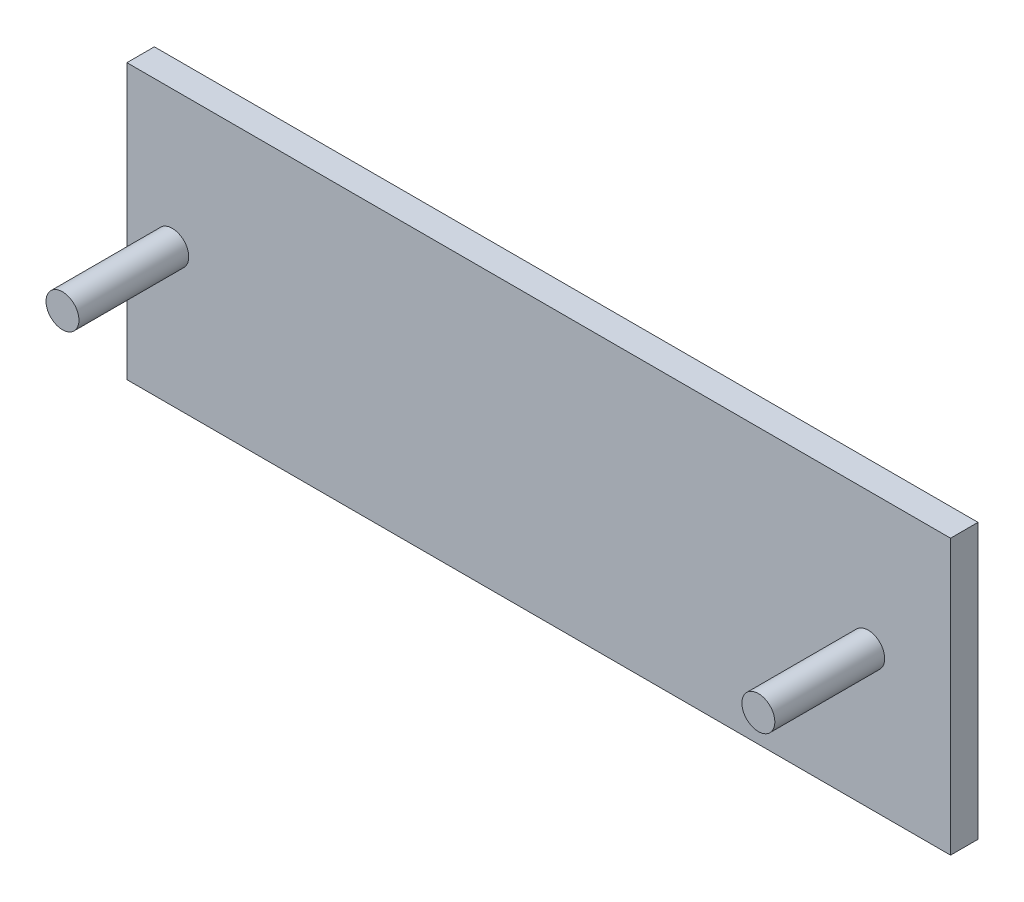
ISO-10303-21;
HEADER;
FILE_DESCRIPTION(('STEP AP214'),'2;1');
FILE_NAME('part.step','',(''),(''),'','','');
FILE_SCHEMA(('AUTOMOTIVE_DESIGN { 1 0 10303 214 1 1 1 1 }'));
ENDSEC;
DATA;
#1=APPLICATION_CONTEXT('core data for automotive mechanical design processes');
#2=APPLICATION_PROTOCOL_DEFINITION('international standard','automotive_design',2000,#1);
#3=PRODUCT_CONTEXT('',#1,'mechanical');
#4=PRODUCT('Part','Part','',(#3));
#5=PRODUCT_RELATED_PRODUCT_CATEGORY('part','',(#4));
#6=PRODUCT_DEFINITION_FORMATION('','',#4);
#7=PRODUCT_DEFINITION_CONTEXT('part definition',#1,'design');
#8=PRODUCT_DEFINITION('design','',#6,#7);
#9=PRODUCT_DEFINITION_SHAPE('','',#8);
#10=(LENGTH_UNIT() NAMED_UNIT(*) SI_UNIT(.MILLI.,.METRE.));
#11=(NAMED_UNIT(*) PLANE_ANGLE_UNIT() SI_UNIT($,.RADIAN.));
#12=(NAMED_UNIT(*) SI_UNIT($,.STERADIAN.) SOLID_ANGLE_UNIT());
#13=UNCERTAINTY_MEASURE_WITH_UNIT(LENGTH_MEASURE(1.E-05),#10,'distance_accuracy_value','');
#14=(GEOMETRIC_REPRESENTATION_CONTEXT(3) GLOBAL_UNCERTAINTY_ASSIGNED_CONTEXT((#13)) GLOBAL_UNIT_ASSIGNED_CONTEXT((#10,
#11,#12)) REPRESENTATION_CONTEXT('',''));
#15=CARTESIAN_POINT('',(0.,0.,0.));
#16=DIRECTION('',(0.,0.,1.));
#17=DIRECTION('',(1.,0.,0.));
#18=AXIS2_PLACEMENT_3D('',#15,#16,#17);
#19=CARTESIAN_POINT('',(0.,100.,10.));
#20=DIRECTION('',(0.,0.,-1.));
#21=DIRECTION('',(-1.,0.,0.));
#22=AXIS2_PLACEMENT_3D('',#19,#20,#21);
#23=PLANE('',#22);
#24=CARTESIAN_POINT('',(16.53,50.,10.));
#25=DIRECTION('',(0.,0.,-1.));
#26=DIRECTION('',(-1.,0.,0.));
#27=AXIS2_PLACEMENT_3D('',#24,#25,#26);
#28=CIRCLE('',#27,6.);
#29=CARTESIAN_POINT('',(10.53,50.,10.));
#30=VERTEX_POINT('',#29);
#31=EDGE_CURVE('E40',#30,#30,#28,.F.);
#32=ORIENTED_EDGE('',*,*,#31,.F.);
#33=EDGE_LOOP('',(#32));
#34=FACE_BOUND('',#33,.T.);
#35=DIRECTION('',(0.,-1.,0.));
#36=VECTOR('',#35,1.);
#37=CARTESIAN_POINT('',(0.,100.,10.));
#38=LINE('',#37,#36);
#39=CARTESIAN_POINT('',(0.,100.,10.));
#40=VERTEX_POINT('',#39);
#41=CARTESIAN_POINT('',(0.,0.,10.));
#42=VERTEX_POINT('',#41);
#43=EDGE_CURVE('E84',#40,#42,#38,.T.);
#44=ORIENTED_EDGE('',*,*,#43,.T.);
#45=DIRECTION('',(1.,0.,0.));
#46=VECTOR('',#45,1.);
#47=CARTESIAN_POINT('',(0.,0.,10.));
#48=LINE('',#47,#46);
#49=CARTESIAN_POINT('',(300.,0.,10.));
#50=VERTEX_POINT('',#49);
#51=EDGE_CURVE('E79',#42,#50,#48,.T.);
#52=ORIENTED_EDGE('',*,*,#51,.T.);
#53=DIRECTION('',(0.,1.,0.));
#54=VECTOR('',#53,1.);
#55=CARTESIAN_POINT('',(300.,0.,10.));
#56=LINE('',#55,#54);
#57=CARTESIAN_POINT('',(300.,100.,10.));
#58=VERTEX_POINT('',#57);
#59=EDGE_CURVE('E82',#50,#58,#56,.T.);
#60=ORIENTED_EDGE('',*,*,#59,.T.);
#61=DIRECTION('',(-1.,0.,0.));
#62=VECTOR('',#61,1.);
#63=CARTESIAN_POINT('',(300.,100.,10.));
#64=LINE('',#63,#62);
#65=EDGE_CURVE('E48',#58,#40,#64,.T.);
#66=ORIENTED_EDGE('',*,*,#65,.T.);
#67=EDGE_LOOP('',(#44,#52,#60,#66));
#68=FACE_BOUND('',#67,.T.);
#69=CARTESIAN_POINT('',(270.,50.,10.));
#70=DIRECTION('',(0.,0.,-1.));
#71=DIRECTION('',(-1.,0.,0.));
#72=AXIS2_PLACEMENT_3D('',#69,#70,#71);
#73=CIRCLE('',#72,5.99999999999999);
#74=CARTESIAN_POINT('',(264.,50.,10.));
#75=VERTEX_POINT('',#74);
#76=EDGE_CURVE('E11',#75,#75,#73,.F.);
#77=ORIENTED_EDGE('',*,*,#76,.F.);
#78=EDGE_LOOP('',(#77));
#79=FACE_BOUND('',#78,.T.);
#80=ADVANCED_FACE('F31',(#34,#68,#79),#23,.F.);
#81=CARTESIAN_POINT('',(0.,100.,10.));
#82=DIRECTION('',(1.,0.,0.));
#83=DIRECTION('',(0.,1.,0.));
#84=AXIS2_PLACEMENT_3D('',#81,#82,#83);
#85=PLANE('',#84);
#86=DIRECTION('',(0.,-1.,0.));
#87=VECTOR('',#86,1.);
#88=CARTESIAN_POINT('',(0.,100.,0.));
#89=LINE('',#88,#87);
#90=CARTESIAN_POINT('',(0.,100.,0.));
#91=VERTEX_POINT('',#90);
#92=CARTESIAN_POINT('',(0.,0.,0.));
#93=VERTEX_POINT('',#92);
#94=EDGE_CURVE('E99',#91,#93,#89,.T.);
#95=ORIENTED_EDGE('',*,*,#94,.T.);
#96=DIRECTION('',(0.,0.,-1.));
#97=VECTOR('',#96,1.);
#98=CARTESIAN_POINT('',(0.,0.,10.));
#99=LINE('',#98,#97);
#100=EDGE_CURVE('E90',#42,#93,#99,.T.);
#101=ORIENTED_EDGE('',*,*,#100,.F.);
#102=ORIENTED_EDGE('',*,*,#43,.F.);
#103=DIRECTION('',(0.,0.,-1.));
#104=VECTOR('',#103,1.);
#105=CARTESIAN_POINT('',(0.,100.,10.));
#106=LINE('',#105,#104);
#107=EDGE_CURVE('E95',#40,#91,#106,.T.);
#108=ORIENTED_EDGE('',*,*,#107,.T.);
#109=EDGE_LOOP('',(#95,#101,#102,#108));
#110=FACE_BOUND('',#109,.T.);
#111=ADVANCED_FACE('F33',(#110),#85,.F.);
#112=CARTESIAN_POINT('',(0.,0.,10.));
#113=DIRECTION('',(0.,1.,0.));
#114=DIRECTION('',(0.,0.,1.));
#115=AXIS2_PLACEMENT_3D('',#112,#113,#114);
#116=PLANE('',#115);
#117=DIRECTION('',(1.,0.,0.));
#118=VECTOR('',#117,1.);
#119=CARTESIAN_POINT('',(0.,0.,0.));
#120=LINE('',#119,#118);
#121=CARTESIAN_POINT('',(300.,0.,0.));
#122=VERTEX_POINT('',#121);
#123=EDGE_CURVE('E89',#93,#122,#120,.T.);
#124=ORIENTED_EDGE('',*,*,#123,.T.);
#125=DIRECTION('',(0.,0.,-1.));
#126=VECTOR('',#125,1.);
#127=CARTESIAN_POINT('',(300.,0.,10.));
#128=LINE('',#127,#126);
#129=EDGE_CURVE('E87',#50,#122,#128,.T.);
#130=ORIENTED_EDGE('',*,*,#129,.F.);
#131=ORIENTED_EDGE('',*,*,#51,.F.);
#132=ORIENTED_EDGE('',*,*,#100,.T.);
#133=EDGE_LOOP('',(#124,#130,#131,#132));
#134=FACE_BOUND('',#133,.T.);
#135=ADVANCED_FACE('F88',(#134),#116,.F.);
#136=CARTESIAN_POINT('',(300.,0.,10.));
#137=DIRECTION('',(-1.,0.,0.));
#138=DIRECTION('',(0.,0.,1.));
#139=AXIS2_PLACEMENT_3D('',#136,#137,#138);
#140=PLANE('',#139);
#141=DIRECTION('',(0.,1.,0.));
#142=VECTOR('',#141,1.);
#143=CARTESIAN_POINT('',(300.,0.,0.));
#144=LINE('',#143,#142);
#145=CARTESIAN_POINT('',(300.,100.,0.));
#146=VERTEX_POINT('',#145);
#147=EDGE_CURVE('E65',#122,#146,#144,.T.);
#148=ORIENTED_EDGE('',*,*,#147,.T.);
#149=DIRECTION('',(0.,0.,-1.));
#150=VECTOR('',#149,1.);
#151=CARTESIAN_POINT('',(300.,100.,10.));
#152=LINE('',#151,#150);
#153=EDGE_CURVE('E91',#58,#146,#152,.T.);
#154=ORIENTED_EDGE('',*,*,#153,.F.);
#155=ORIENTED_EDGE('',*,*,#59,.F.);
#156=ORIENTED_EDGE('',*,*,#129,.T.);
#157=EDGE_LOOP('',(#148,#154,#155,#156));
#158=FACE_BOUND('',#157,.T.);
#159=ADVANCED_FACE('F93',(#158),#140,.F.);
#160=CARTESIAN_POINT('',(300.,100.,10.));
#161=DIRECTION('',(0.,-1.,0.));
#162=DIRECTION('',(1.,0.,0.));
#163=AXIS2_PLACEMENT_3D('',#160,#161,#162);
#164=PLANE('',#163);
#165=DIRECTION('',(-1.,0.,0.));
#166=VECTOR('',#165,1.);
#167=CARTESIAN_POINT('',(300.,100.,0.));
#168=LINE('',#167,#166);
#169=EDGE_CURVE('E71',#146,#91,#168,.T.);
#170=ORIENTED_EDGE('',*,*,#169,.T.);
#171=ORIENTED_EDGE('',*,*,#107,.F.);
#172=ORIENTED_EDGE('',*,*,#65,.F.);
#173=ORIENTED_EDGE('',*,*,#153,.T.);
#174=EDGE_LOOP('',(#170,#171,#172,#173));
#175=FACE_BOUND('',#174,.T.);
#176=ADVANCED_FACE('F125',(#175),#164,.F.);
#177=CARTESIAN_POINT('',(0.,100.,0.));
#178=DIRECTION('',(0.,0.,-1.));
#179=DIRECTION('',(-1.,0.,0.));
#180=AXIS2_PLACEMENT_3D('',#177,#178,#179);
#181=PLANE('',#180);
#182=ORIENTED_EDGE('',*,*,#94,.F.);
#183=ORIENTED_EDGE('',*,*,#169,.F.);
#184=ORIENTED_EDGE('',*,*,#147,.F.);
#185=ORIENTED_EDGE('',*,*,#123,.F.);
#186=EDGE_LOOP('',(#182,#183,#184,#185));
#187=FACE_BOUND('',#186,.T.);
#188=ADVANCED_FACE('F122',(#187),#181,.T.);
#189=CARTESIAN_POINT('',(16.53,50.,50.));
#190=DIRECTION('',(0.,0.,-1.));
#191=DIRECTION('',(-1.,0.,0.));
#192=AXIS2_PLACEMENT_3D('',#189,#190,#191);
#193=CYLINDRICAL_SURFACE('',#192,6.);
#194=CARTESIAN_POINT('',(16.53,50.,50.));
#195=DIRECTION('',(0.,0.,1.));
#196=DIRECTION('',(1.,0.,0.));
#197=AXIS2_PLACEMENT_3D('',#194,#195,#196);
#198=CIRCLE('',#197,6.);
#199=CARTESIAN_POINT('',(22.53,50.,50.));
#200=VERTEX_POINT('',#199);
#201=EDGE_CURVE('E102',#200,#200,#198,.T.);
#202=ORIENTED_EDGE('',*,*,#201,.F.);
#203=EDGE_LOOP('',(#202));
#204=FACE_BOUND('',#203,.T.);
#205=ORIENTED_EDGE('',*,*,#31,.T.);
#206=EDGE_LOOP('',(#205));
#207=FACE_BOUND('',#206,.T.);
#208=ADVANCED_FACE('F111',(#204,#207),#193,.T.);
#209=CARTESIAN_POINT('',(16.53,50.,50.));
#210=DIRECTION('',(0.,0.,1.));
#211=DIRECTION('',(1.,0.,0.));
#212=AXIS2_PLACEMENT_3D('',#209,#210,#211);
#213=PLANE('',#212);
#214=ORIENTED_EDGE('',*,*,#201,.T.);
#215=EDGE_LOOP('',(#214));
#216=FACE_BOUND('',#215,.T.);
#217=ADVANCED_FACE('F153',(#216),#213,.T.);
#218=CARTESIAN_POINT('',(270.,50.,50.));
#219=DIRECTION('',(0.,0.,-1.));
#220=DIRECTION('',(-1.,0.,0.));
#221=AXIS2_PLACEMENT_3D('',#218,#219,#220);
#222=CYLINDRICAL_SURFACE('',#221,5.99999999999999);
#223=CARTESIAN_POINT('',(270.,50.,50.));
#224=DIRECTION('',(0.,0.,1.));
#225=DIRECTION('',(1.,0.,0.));
#226=AXIS2_PLACEMENT_3D('',#223,#224,#225);
#227=CIRCLE('',#226,5.99999999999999);
#228=CARTESIAN_POINT('',(276.,50.,50.));
#229=VERTEX_POINT('',#228);
#230=EDGE_CURVE('E204',#229,#229,#227,.T.);
#231=ORIENTED_EDGE('',*,*,#230,.F.);
#232=EDGE_LOOP('',(#231));
#233=FACE_BOUND('',#232,.T.);
#234=ORIENTED_EDGE('',*,*,#76,.T.);
#235=EDGE_LOOP('',(#234));
#236=FACE_BOUND('',#235,.T.);
#237=ADVANCED_FACE('F160',(#233,#236),#222,.T.);
#238=CARTESIAN_POINT('',(270.,50.,50.));
#239=DIRECTION('',(0.,0.,1.));
#240=DIRECTION('',(1.,0.,0.));
#241=AXIS2_PLACEMENT_3D('',#238,#239,#240);
#242=PLANE('',#241);
#243=ORIENTED_EDGE('',*,*,#230,.T.);
#244=EDGE_LOOP('',(#243));
#245=FACE_BOUND('',#244,.T.);
#246=ADVANCED_FACE('F167',(#245),#242,.T.);
#247=CLOSED_SHELL('',(#80,#111,#135,#159,#176,#188,#208,#217,#237,#246));
#248=MANIFOLD_SOLID_BREP('B2',#247);
#249=ADVANCED_BREP_SHAPE_REPRESENTATION('',(#18,#248),#14);
#250=SHAPE_DEFINITION_REPRESENTATION(#9,#249);
ENDSEC;
END-ISO-10303-21;
